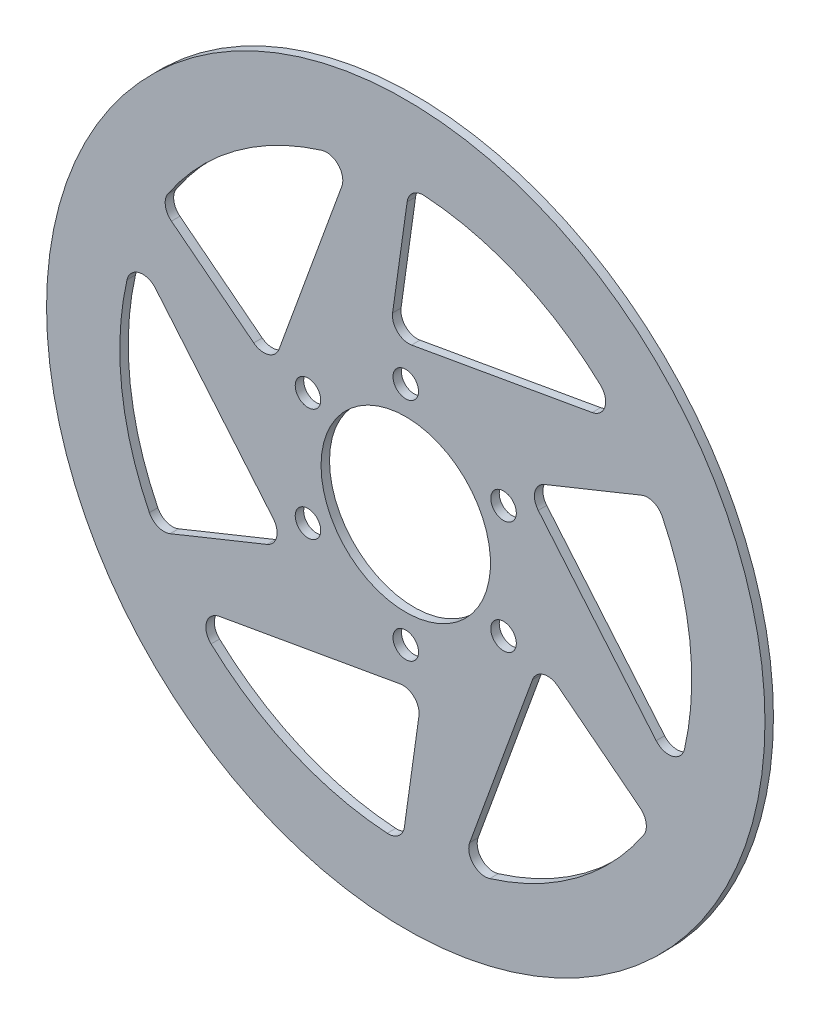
from build123d import *

# Parameters (mm, degrees)
SKETCH2_R           = 70
SKETCH2_R_2         = 16.51
BOSS_EXTRUDE1_DEPTH = 1.651
SKETCH3_R           = 2.4892
CUT_EXTRUDE2_DEPTH  = 100.008715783
CIRPATTERN1_COUNT   = 6
CUT_EXTRUDE3_DEPTH  = 100.008715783
CIRPATTERN2_COUNT   = 6


with BuildPart() as part:
    # Sketch2 → Boss-Extrude1 (new body)
    with BuildSketch(Plane.XY):
        with Locations(Location((0, 0, 0), (0, 0, 180))):
            Circle(SKETCH2_R)
        with Locations(Location((0, 0, 0), (0, 0, 180))):
            Circle(SKETCH2_R_2, mode=Mode.SUBTRACT)
    extrude(amount=BOSS_EXTRUDE1_DEPTH)

    # Sketch3 → Cut-Extrude2 (cut, through all)
    with BuildSketch(Plane.XY):
        with Locations(Location((0, 22, 0), (0, 0, 180))):
            Circle(SKETCH3_R)
    cut_extrude2 = extrude(amount=CUT_EXTRUDE2_DEPTH, mode=Mode.SUBTRACT)

    # CirPattern1: Cut-Extrude2 ×6 about axis
    cirpattern1_axis = Axis((0, 0, 0), (0, 0, 1))
    for i in range(1, CIRPATTERN1_COUNT):
        add(cut_extrude2.rotate(cirpattern1_axis, i * 360 / CIRPATTERN1_COUNT), mode=Mode.SUBTRACT)

    # Sketch4 → Cut-Extrude3 (cut, through all)
    with BuildSketch(Plane.XY):
        with BuildLine():
            Line((-2.566811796, 32.72554725), (0.265897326, 52.881319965))
            ThreePointArc((0.265897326, 52.881319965), (1.405895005, 54.902003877), (3.616025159, 55.60775375))
            ThreePointArc((3.616025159, 55.60775375), (22.054533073, 51.175145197), (37.938891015, 40.815909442))
            ThreePointArc((37.938891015, 40.815909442), (38.822260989, 37.591081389), (36.32861704, 35.363616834))
            Line((36.32861704, 35.363616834), (1.128622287, 29.156908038))
            ThreePointArc((1.128622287, 29.156908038), (-1.628251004, 29.999768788), (-2.566811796, 32.72554725))
        make_face()
    cut_extrude3 = extrude(amount=CUT_EXTRUDE3_DEPTH, mode=Mode.SUBTRACT)

    # CirPattern2: Cut-Extrude3 ×6 about axis
    cirpattern2_axis = Axis((0, 0, 0), (0, 0, 1))
    for i in range(1, CIRPATTERN2_COUNT):
        add(cut_extrude3.rotate(cirpattern2_axis, i * 360 / CIRPATTERN2_COUNT), mode=Mode.SUBTRACT)


solid = part.part
